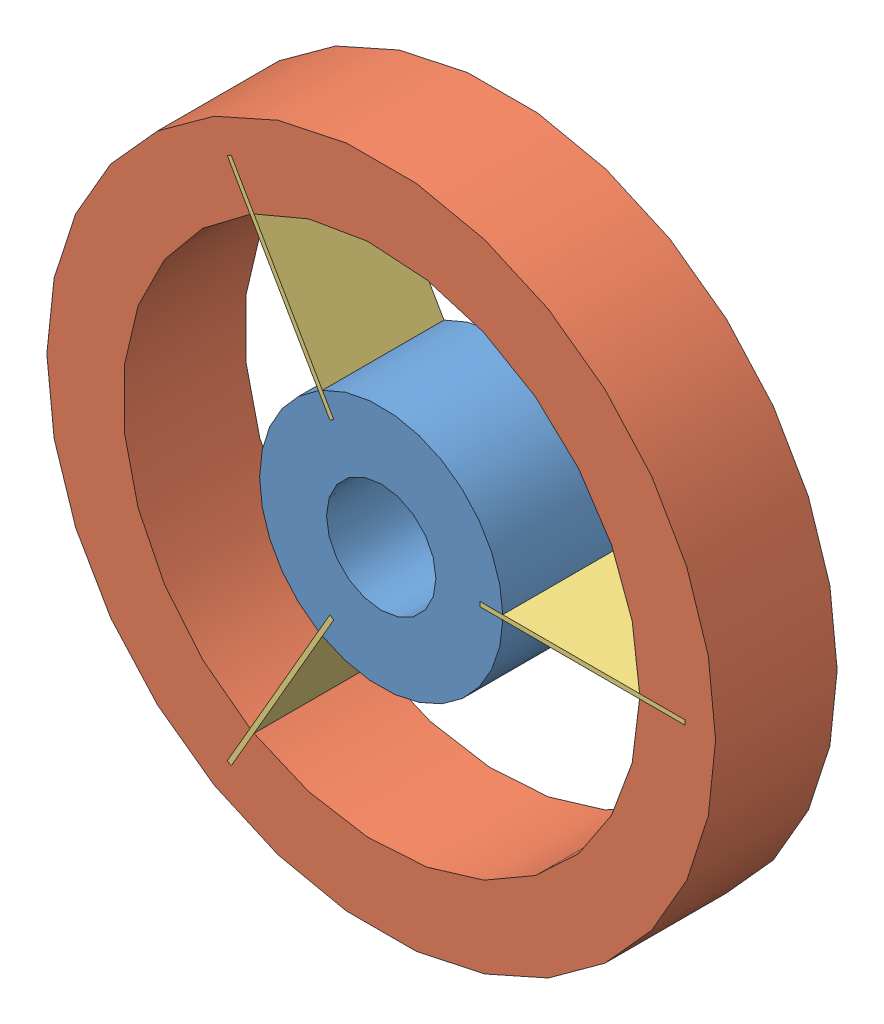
SolidWorks assembly wheel.SLDASM, configuration Default (file format 3100). Lengths in mm.
Overall size (220 220 40).
5 component instances, 3 part files, 11 mates.
Components (placement in the parent):
- hub-1: hub.SLDPRT [Default] at origin size (79.99 80 40)
- rim-1: rim.SLDPRT [Default] at origin size (220 220 40)
- spoke-1: spoke.SLDPRT [Default] at (100 -0.75 0) x (0 0 1) z (-1 0 0) size (40 1.5 67.5)
- spoke-2: spoke.SLDPRT [Default] at (-50.6495 -86.2275 0) x (0 0 1) z (0.5 0.866025 0) size (40 1.5 67.5)
- spoke-3: spoke.SLDPRT [Default] at (-49.3505 86.9775 0) x (0 0 1) z (0.5 -0.866025 0) size (40 1.5 67.5)
Mates (geometry in assembly coordinates):
- Concentric1: concentric anti-aligned: cylinder of hub-1; cylinder of rim-1
- Coincident1: coincident aligned: plane of hub-1 through (0 0 40) normal (0 0 1); plane of rim-1 through (0 0 40) normal (0 0 1)
- Coincident6: coincident anti-aligned: plane of hub-1 through (32.5 0.75 0) normal (1 0 0); plane of spoke-1 through (32.5 0.75 0) normal (-1 0 0)
- Coincident7: coincident anti-aligned: plane of hub-1 through (40 0.75 0) normal (0 -1 0); plane of spoke-1 through (32.5 0.75 0) normal (0 1 0)
- Coincident8: coincident aligned: plane of hub-1 through (0 0 0) normal (0 0 -1); plane of spoke-1 through (32.5 -0.75 0) normal (0 0 -1)
- Coincident9: coincident anti-aligned: plane of hub-1 through (-15.6005 -28.5208 0) normal (-0.5 -0.866025 0); plane of spoke-2 through (-15.6005 -28.5208 0) normal (0.5 0.866025 0)
- Coincident10: coincident anti-aligned: plane of hub-1 through (-19.3505 -35.016 0) normal (-0.866025 0.5 0); plane of spoke-2 through (-15.6005 -28.5208 0) normal (0.866025 -0.5 0)
- Coincident11: coincident aligned: plane of hub-1 through (0 0 40) normal (0 0 1); plane of spoke-2 through (-16.8995 -27.7708 40) normal (0 0 1)
- Coincident12: coincident anti-aligned: plane of hub-1 through (-16.8995 27.7708 0) normal (-0.5 0.866025 0); plane of spoke-3 through (-16.8995 27.7708 0) normal (0.5 -0.866025 0)
- Coincident13: coincident anti-aligned: plane of hub-1 through (-20.6495 34.266 0) normal (0.866025 0.5 0); plane of spoke-3 through (-16.8995 27.7708 0) normal (-0.866025 -0.5 0)
- Coincident14: coincident aligned: plane of hub-1 through (0 0 40) normal (0 0 1); plane of spoke-3 through (-15.6005 28.5208 40) normal (0 0 1)
